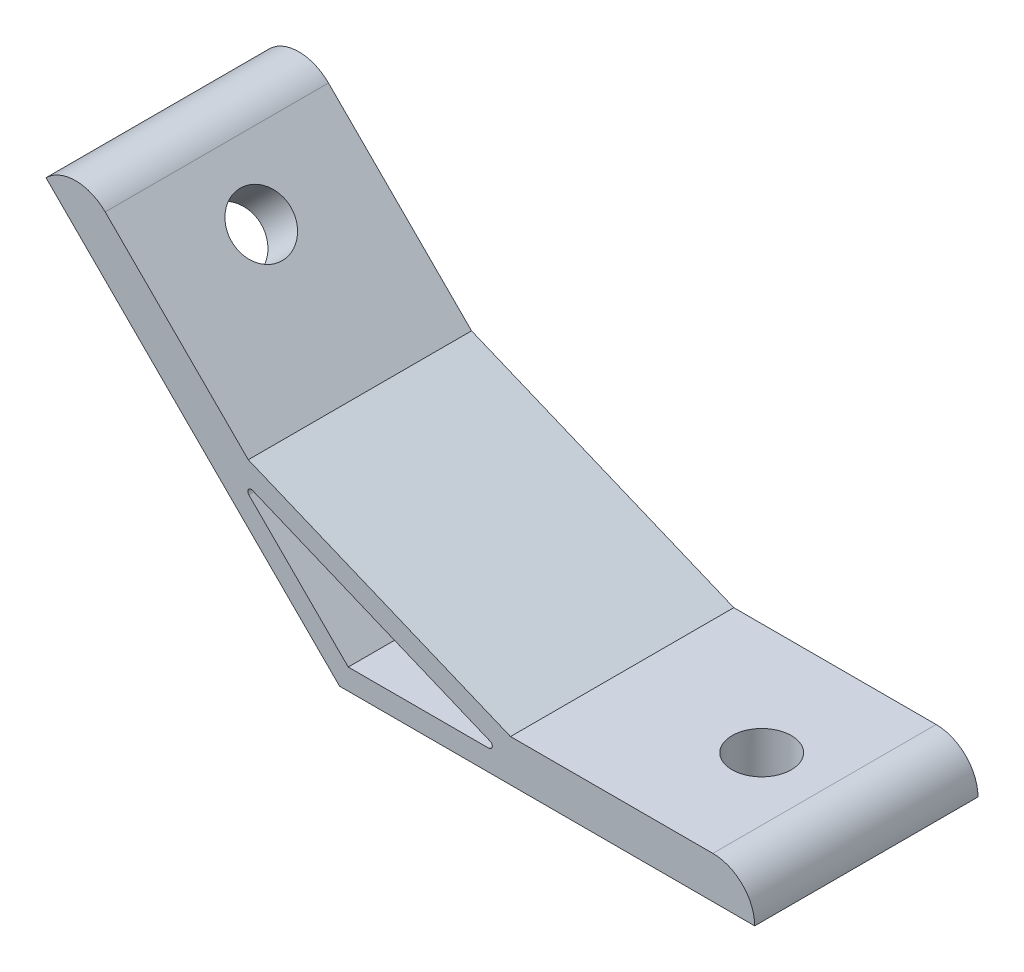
ISO-10303-21;
HEADER;
FILE_DESCRIPTION(('STEP AP214'),'2;1');
FILE_NAME('part.step','',(''),(''),'','','');
FILE_SCHEMA(('AUTOMOTIVE_DESIGN { 1 0 10303 214 1 1 1 1 }'));
ENDSEC;
DATA;
#1=APPLICATION_CONTEXT('core data for automotive mechanical design processes');
#2=APPLICATION_PROTOCOL_DEFINITION('international standard','automotive_design',2000,#1);
#3=PRODUCT_CONTEXT('',#1,'mechanical');
#4=PRODUCT('Part','Part','',(#3));
#5=PRODUCT_RELATED_PRODUCT_CATEGORY('part','',(#4));
#6=PRODUCT_DEFINITION_FORMATION('','',#4);
#7=PRODUCT_DEFINITION_CONTEXT('part definition',#1,'design');
#8=PRODUCT_DEFINITION('design','',#6,#7);
#9=PRODUCT_DEFINITION_SHAPE('','',#8);
#10=(LENGTH_UNIT() NAMED_UNIT(*) SI_UNIT(.MILLI.,.METRE.));
#11=(NAMED_UNIT(*) PLANE_ANGLE_UNIT() SI_UNIT($,.RADIAN.));
#12=(NAMED_UNIT(*) SI_UNIT($,.STERADIAN.) SOLID_ANGLE_UNIT());
#13=UNCERTAINTY_MEASURE_WITH_UNIT(LENGTH_MEASURE(1.E-05),#10,'distance_accuracy_value','');
#14=(GEOMETRIC_REPRESENTATION_CONTEXT(3) GLOBAL_UNCERTAINTY_ASSIGNED_CONTEXT((#13)) GLOBAL_UNIT_ASSIGNED_CONTEXT((#10,
#11,#12)) REPRESENTATION_CONTEXT('',''));
#15=CARTESIAN_POINT('',(0.,0.,0.));
#16=DIRECTION('',(0.,0.,1.));
#17=DIRECTION('',(1.,0.,0.));
#18=AXIS2_PLACEMENT_3D('',#15,#16,#17);
#19=CARTESIAN_POINT('',(0.,0.,16.));
#20=DIRECTION('',(0.,1.,0.));
#21=DIRECTION('',(0.,0.,1.));
#22=AXIS2_PLACEMENT_3D('',#19,#20,#21);
#23=PLANE('',#22);
#24=DIRECTION('',(1.,0.,0.));
#25=VECTOR('',#24,1.);
#26=CARTESIAN_POINT('',(0.,0.,-16.));
#27=LINE('',#26,#25);
#28=CARTESIAN_POINT('',(0.,0.,-16.));
#29=VERTEX_POINT('',#28);
#30=CARTESIAN_POINT('',(59.5,0.,-16.));
#31=VERTEX_POINT('',#30);
#32=EDGE_CURVE('E171',#29,#31,#27,.T.);
#33=ORIENTED_EDGE('',*,*,#32,.T.);
#34=DIRECTION('',(0.,0.,-1.));
#35=VECTOR('',#34,1.);
#36=CARTESIAN_POINT('',(59.5,0.,16.));
#37=LINE('',#36,#35);
#38=CARTESIAN_POINT('',(59.5,0.,16.));
#39=VERTEX_POINT('',#38);
#40=EDGE_CURVE('E188',#39,#31,#37,.T.);
#41=ORIENTED_EDGE('',*,*,#40,.F.);
#42=DIRECTION('',(1.,0.,0.));
#43=VECTOR('',#42,1.);
#44=CARTESIAN_POINT('',(0.,0.,16.));
#45=LINE('',#44,#43);
#46=CARTESIAN_POINT('',(0.,0.,16.));
#47=VERTEX_POINT('',#46);
#48=EDGE_CURVE('E158',#47,#39,#45,.T.);
#49=ORIENTED_EDGE('',*,*,#48,.F.);
#50=DIRECTION('',(0.,0.,-1.));
#51=VECTOR('',#50,1.);
#52=CARTESIAN_POINT('',(0.,0.,16.));
#53=LINE('',#52,#51);
#54=EDGE_CURVE('E191',#47,#29,#53,.T.);
#55=ORIENTED_EDGE('',*,*,#54,.T.);
#56=EDGE_LOOP('',(#33,#41,#49,#55));
#57=FACE_BOUND('',#56,.T.);
#58=CARTESIAN_POINT('',(44.5,0.,0.));
#59=DIRECTION('',(0.,1.,0.));
#60=DIRECTION('',(-1.,0.,0.));
#61=AXIS2_PLACEMENT_3D('',#58,#59,#60);
#62=CIRCLE('',#61,4.25);
#63=CARTESIAN_POINT('',(40.25,0.,0.));
#64=VERTEX_POINT('',#63);
#65=EDGE_CURVE('E216',#64,#64,#62,.T.);
#66=ORIENTED_EDGE('',*,*,#65,.T.);
#67=EDGE_LOOP('',(#66));
#68=FACE_BOUND('',#67,.T.);
#69=ADVANCED_FACE('F36',(#57,#68),#23,.F.);
#70=CARTESIAN_POINT('',(59.5,6.,16.));
#71=DIRECTION('',(0.,-1.,0.));
#72=DIRECTION('',(1.,0.,0.));
#73=AXIS2_PLACEMENT_3D('',#70,#71,#72);
#74=PLANE('',#73);
#75=DIRECTION('',(-1.,0.,0.));
#76=VECTOR('',#75,1.);
#77=CARTESIAN_POINT('',(59.5,6.,16.));
#78=LINE('',#77,#76);
#79=CARTESIAN_POINT('',(53.5,6.,16.));
#80=VERTEX_POINT('',#79);
#81=CARTESIAN_POINT('',(24.5,6.,16.));
#82=VERTEX_POINT('',#81);
#83=EDGE_CURVE('E161',#80,#82,#78,.T.);
#84=ORIENTED_EDGE('',*,*,#83,.F.);
#85=DIRECTION('',(0.,0.,-1.));
#86=VECTOR('',#85,1.);
#87=CARTESIAN_POINT('',(53.5,6.,16.));
#88=LINE('',#87,#86);
#89=CARTESIAN_POINT('',(53.5,6.,-16.));
#90=VERTEX_POINT('',#89);
#91=EDGE_CURVE('E212',#80,#90,#88,.T.);
#92=ORIENTED_EDGE('',*,*,#91,.T.);
#93=DIRECTION('',(-1.,0.,0.));
#94=VECTOR('',#93,1.);
#95=CARTESIAN_POINT('',(59.5,6.,-16.));
#96=LINE('',#95,#94);
#97=CARTESIAN_POINT('',(24.5,6.,-16.));
#98=VERTEX_POINT('',#97);
#99=EDGE_CURVE('E174',#90,#98,#96,.T.);
#100=ORIENTED_EDGE('',*,*,#99,.T.);
#101=DIRECTION('',(0.,0.,-1.));
#102=VECTOR('',#101,1.);
#103=CARTESIAN_POINT('',(24.5,6.,16.));
#104=LINE('',#103,#102);
#105=EDGE_CURVE('E185',#82,#98,#104,.T.);
#106=ORIENTED_EDGE('',*,*,#105,.F.);
#107=EDGE_LOOP('',(#84,#92,#100,#106));
#108=FACE_BOUND('',#107,.T.);
#109=CARTESIAN_POINT('',(44.5,5.99999999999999,0.));
#110=DIRECTION('',(0.,-1.,0.));
#111=DIRECTION('',(1.,0.,0.));
#112=AXIS2_PLACEMENT_3D('',#109,#110,#111);
#113=CIRCLE('',#112,4.25);
#114=CARTESIAN_POINT('',(48.75,6.,0.));
#115=VERTEX_POINT('',#114);
#116=EDGE_CURVE('E213',#115,#115,#113,.F.);
#117=ORIENTED_EDGE('',*,*,#116,.F.);
#118=EDGE_LOOP('',(#117));
#119=FACE_BOUND('',#118,.T.);
#120=ADVANCED_FACE('F250',(#108,#119),#74,.F.);
#121=CARTESIAN_POINT('',(0.,0.,16.));
#122=DIRECTION('',(0.707106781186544,0.707106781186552,0.));
#123=DIRECTION('',(-0.707106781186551,0.707106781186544,0.));
#124=AXIS2_PLACEMENT_3D('',#121,#122,#123);
#125=PLANE('',#124);
#126=CARTESIAN_POINT('',(-31.4662517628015,31.4662517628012,0.));
#127=DIRECTION('',(-0.707106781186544,-0.707106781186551,0.));
#128=DIRECTION('',(0.707106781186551,-0.707106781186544,0.));
#129=AXIS2_PLACEMENT_3D('',#126,#127,#128);
#130=CIRCLE('',#129,4.25);
#131=CARTESIAN_POINT('',(-28.4610479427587,28.4610479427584,0.));
#132=VERTEX_POINT('',#131);
#133=EDGE_CURVE('E206',#132,#132,#130,.T.);
#134=ORIENTED_EDGE('',*,*,#133,.F.);
#135=EDGE_LOOP('',(#134));
#136=FACE_BOUND('',#135,.T.);
#137=DIRECTION('',(0.707106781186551,-0.707106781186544,0.));
#138=VECTOR('',#137,1.);
#139=CARTESIAN_POINT('',(0.,0.,-16.));
#140=LINE('',#139,#138);
#141=CARTESIAN_POINT('',(-42.0728534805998,42.0728534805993,-16.));
#142=VERTEX_POINT('',#141);
#143=EDGE_CURVE('E142',#142,#29,#140,.T.);
#144=ORIENTED_EDGE('',*,*,#143,.T.);
#145=ORIENTED_EDGE('',*,*,#54,.F.);
#146=DIRECTION('',(0.707106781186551,-0.707106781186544,0.));
#147=VECTOR('',#146,1.);
#148=CARTESIAN_POINT('',(0.,0.,16.));
#149=LINE('',#148,#147);
#150=CARTESIAN_POINT('',(-42.0728534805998,42.0728534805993,16.));
#151=VERTEX_POINT('',#150);
#152=EDGE_CURVE('E155',#151,#47,#149,.T.);
#153=ORIENTED_EDGE('',*,*,#152,.F.);
#154=DIRECTION('',(0.,0.,-1.));
#155=VECTOR('',#154,1.);
#156=CARTESIAN_POINT('',(-42.0728534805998,42.0728534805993,16.));
#157=LINE('',#156,#155);
#158=EDGE_CURVE('E168',#151,#142,#157,.T.);
#159=ORIENTED_EDGE('',*,*,#158,.T.);
#160=EDGE_LOOP('',(#144,#145,#153,#159));
#161=FACE_BOUND('',#160,.T.);
#162=ADVANCED_FACE('F256',(#136,#161),#125,.F.);
#163=CARTESIAN_POINT('',(-13.0814754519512,21.5667568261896,16.));
#164=DIRECTION('',(-0.382683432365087,-0.923879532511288,0.));
#165=DIRECTION('',(0.923879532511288,-0.382683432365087,0.));
#166=AXIS2_PLACEMENT_3D('',#163,#164,#165);
#167=PLANE('',#166);
#168=DIRECTION('',(-0.923879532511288,0.382683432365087,0.));
#169=VECTOR('',#168,1.);
#170=CARTESIAN_POINT('',(-13.0814754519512,21.5667568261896,-16.));
#171=LINE('',#170,#169);
#172=CARTESIAN_POINT('',(-13.0814754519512,21.5667568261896,-16.));
#173=VERTEX_POINT('',#172);
#174=EDGE_CURVE('E176',#98,#173,#171,.T.);
#175=ORIENTED_EDGE('',*,*,#174,.T.);
#176=DIRECTION('',(0.,0.,-1.));
#177=VECTOR('',#176,1.);
#178=CARTESIAN_POINT('',(-13.0814754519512,21.5667568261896,16.));
#179=LINE('',#178,#177);
#180=CARTESIAN_POINT('',(-13.0814754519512,21.5667568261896,16.));
#181=VERTEX_POINT('',#180);
#182=EDGE_CURVE('E182',#181,#173,#179,.T.);
#183=ORIENTED_EDGE('',*,*,#182,.F.);
#184=DIRECTION('',(-0.923879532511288,0.382683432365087,0.));
#185=VECTOR('',#184,1.);
#186=CARTESIAN_POINT('',(-13.0814754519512,21.5667568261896,16.));
#187=LINE('',#186,#185);
#188=EDGE_CURVE('E163',#82,#181,#187,.T.);
#189=ORIENTED_EDGE('',*,*,#188,.F.);
#190=ORIENTED_EDGE('',*,*,#105,.T.);
#191=EDGE_LOOP('',(#175,#183,#189,#190));
#192=FACE_BOUND('',#191,.T.);
#193=ADVANCED_FACE('F262',(#192),#167,.F.);
#194=CARTESIAN_POINT('',(-37.8302127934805,46.3154941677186,16.));
#195=DIRECTION('',(-0.707106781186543,-0.707106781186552,0.));
#196=DIRECTION('',(0.707106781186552,-0.707106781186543,0.));
#197=AXIS2_PLACEMENT_3D('',#194,#195,#196);
#198=PLANE('',#197);
#199=CARTESIAN_POINT('',(-27.2236110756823,35.7088924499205,0.));
#200=DIRECTION('',(-0.707106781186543,-0.707106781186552,0.));
#201=DIRECTION('',(0.707106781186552,-0.707106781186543,0.));
#202=AXIS2_PLACEMENT_3D('',#199,#200,#201);
#203=CIRCLE('',#202,4.25);
#204=CARTESIAN_POINT('',(-24.2184072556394,32.7036886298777,0.));
#205=VERTEX_POINT('',#204);
#206=EDGE_CURVE('E152',#205,#205,#203,.T.);
#207=ORIENTED_EDGE('',*,*,#206,.T.);
#208=EDGE_LOOP('',(#207));
#209=FACE_BOUND('',#208,.T.);
#210=DIRECTION('',(-0.707106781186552,0.707106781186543,0.));
#211=VECTOR('',#210,1.);
#212=CARTESIAN_POINT('',(-37.8302127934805,46.3154941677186,-16.));
#213=LINE('',#212,#211);
#214=CARTESIAN_POINT('',(-33.5875721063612,42.0728534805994,-16.));
#215=VERTEX_POINT('',#214);
#216=EDGE_CURVE('E159',#173,#215,#213,.T.);
#217=ORIENTED_EDGE('',*,*,#216,.T.);
#218=DIRECTION('',(0.,0.,-1.));
#219=VECTOR('',#218,1.);
#220=CARTESIAN_POINT('',(-33.5875721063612,42.0728534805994,16.));
#221=LINE('',#220,#219);
#222=CARTESIAN_POINT('',(-33.5875721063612,42.0728534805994,16.));
#223=VERTEX_POINT('',#222);
#224=EDGE_CURVE('E208',#215,#223,#221,.F.);
#225=ORIENTED_EDGE('',*,*,#224,.T.);
#226=DIRECTION('',(-0.707106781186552,0.707106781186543,0.));
#227=VECTOR('',#226,1.);
#228=CARTESIAN_POINT('',(-37.8302127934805,46.3154941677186,16.));
#229=LINE('',#228,#227);
#230=EDGE_CURVE('E165',#181,#223,#229,.T.);
#231=ORIENTED_EDGE('',*,*,#230,.F.);
#232=ORIENTED_EDGE('',*,*,#182,.T.);
#233=EDGE_LOOP('',(#217,#225,#231,#232));
#234=FACE_BOUND('',#233,.T.);
#235=ADVANCED_FACE('F267',(#209,#234),#198,.F.);
#236=CARTESIAN_POINT('',(-42.0728534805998,42.0728534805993,16.));
#237=DIRECTION('',(0.,0.,-1.));
#238=DIRECTION('',(-1.,0.,0.));
#239=AXIS2_PLACEMENT_3D('',#236,#237,#238);
#240=PLANE('',#239);
#241=DIRECTION('',(1.,0.,0.));
#242=VECTOR('',#241,1.);
#243=CARTESIAN_POINT('',(1.24264068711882,3.,16.));
#244=LINE('',#243,#242);
#245=CARTESIAN_POINT('',(1.24264068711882,3.,16.));
#246=VERTEX_POINT('',#245);
#247=CARTESIAN_POINT('',(21.3895931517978,3.,16.));
#248=VERTEX_POINT('',#247);
#249=EDGE_CURVE('E151',#246,#248,#244,.T.);
#250=ORIENTED_EDGE('',*,*,#249,.F.);
#251=DIRECTION('',(0.707106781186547,-0.707106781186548,0.));
#252=VECTOR('',#251,1.);
#253=CARTESIAN_POINT('',(-14.7808389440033,19.0234796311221,16.));
#254=LINE('',#253,#252);
#255=CARTESIAN_POINT('',(-13.0034060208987,17.2460467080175,16.));
#256=VERTEX_POINT('',#255);
#257=EDGE_CURVE('E141',#256,#246,#254,.T.);
#258=ORIENTED_EDGE('',*,*,#257,.F.);
#259=CARTESIAN_POINT('',(-12.6498526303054,17.5996000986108,16.));
#260=DIRECTION('',(0.,0.,-1.));
#261=DIRECTION('',(-1.,0.,0.));
#262=AXIS2_PLACEMENT_3D('',#259,#260,#261);
#263=CIRCLE('',#262,0.5);
#264=CARTESIAN_POINT('',(-12.4585109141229,18.0615398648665,16.));
#265=VERTEX_POINT('',#264);
#266=EDGE_CURVE('E199',#256,#265,#263,.T.);
#267=ORIENTED_EDGE('',*,*,#266,.T.);
#268=DIRECTION('',(-0.923879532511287,0.38268343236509,0.));
#269=VECTOR('',#268,1.);
#270=CARTESIAN_POINT('',(-14.7808389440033,19.0234796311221,16.));
#271=LINE('',#270,#269);
#272=CARTESIAN_POINT('',(21.5809348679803,3.96193976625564,16.));
#273=VERTEX_POINT('',#272);
#274=EDGE_CURVE('E135',#273,#265,#271,.T.);
#275=ORIENTED_EDGE('',*,*,#274,.F.);
#276=CARTESIAN_POINT('',(21.3895931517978,3.5,16.));
#277=DIRECTION('',(0.,0.,-1.));
#278=DIRECTION('',(-1.,0.,0.));
#279=AXIS2_PLACEMENT_3D('',#276,#277,#278);
#280=CIRCLE('',#279,0.5);
#281=EDGE_CURVE('E44',#273,#248,#280,.T.);
#282=ORIENTED_EDGE('',*,*,#281,.T.);
#283=EDGE_LOOP('',(#250,#258,#267,#275,#282));
#284=FACE_BOUND('',#283,.T.);
#285=ORIENTED_EDGE('',*,*,#48,.T.);
#286=CARTESIAN_POINT('',(53.5,0.,16.));
#287=DIRECTION('',(0.,0.,-1.));
#288=DIRECTION('',(-1.,0.,0.));
#289=AXIS2_PLACEMENT_3D('',#286,#287,#288);
#290=CIRCLE('',#289,6.);
#291=EDGE_CURVE('E221',#39,#80,#290,.F.);
#292=ORIENTED_EDGE('',*,*,#291,.T.);
#293=ORIENTED_EDGE('',*,*,#83,.T.);
#294=ORIENTED_EDGE('',*,*,#188,.T.);
#295=ORIENTED_EDGE('',*,*,#230,.T.);
#296=CARTESIAN_POINT('',(-37.8302127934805,37.8302127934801,16.));
#297=DIRECTION('',(0.,0.,-1.));
#298=DIRECTION('',(-1.,0.,0.));
#299=AXIS2_PLACEMENT_3D('',#296,#297,#298);
#300=CIRCLE('',#299,6.);
#301=EDGE_CURVE('E210',#223,#151,#300,.F.);
#302=ORIENTED_EDGE('',*,*,#301,.T.);
#303=ORIENTED_EDGE('',*,*,#152,.T.);
#304=EDGE_LOOP('',(#285,#292,#293,#294,#295,#302,#303));
#305=FACE_BOUND('',#304,.T.);
#306=ADVANCED_FACE('F231',(#284,#305),#240,.F.);
#307=CARTESIAN_POINT('',(-42.0728534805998,42.0728534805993,-16.));
#308=DIRECTION('',(0.,0.,-1.));
#309=DIRECTION('',(-1.,0.,0.));
#310=AXIS2_PLACEMENT_3D('',#307,#308,#309);
#311=PLANE('',#310);
#312=DIRECTION('',(1.,0.,0.));
#313=VECTOR('',#312,1.);
#314=CARTESIAN_POINT('',(1.24264068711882,3.,-16.));
#315=LINE('',#314,#313);
#316=CARTESIAN_POINT('',(1.24264068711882,3.,-16.));
#317=VERTEX_POINT('',#316);
#318=CARTESIAN_POINT('',(21.3895931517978,3.,-16.));
#319=VERTEX_POINT('',#318);
#320=EDGE_CURVE('E128',#317,#319,#315,.T.);
#321=ORIENTED_EDGE('',*,*,#320,.T.);
#322=CARTESIAN_POINT('',(21.3895931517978,3.5,-16.));
#323=DIRECTION('',(0.,0.,-1.));
#324=DIRECTION('',(-1.,0.,0.));
#325=AXIS2_PLACEMENT_3D('',#322,#323,#324);
#326=CIRCLE('',#325,0.5);
#327=CARTESIAN_POINT('',(21.5809348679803,3.96193976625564,-16.));
#328=VERTEX_POINT('',#327);
#329=EDGE_CURVE('E11',#319,#328,#326,.F.);
#330=ORIENTED_EDGE('',*,*,#329,.T.);
#331=DIRECTION('',(-0.923879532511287,0.38268343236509,0.));
#332=VECTOR('',#331,1.);
#333=CARTESIAN_POINT('',(-14.7808389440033,19.0234796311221,-16.));
#334=LINE('',#333,#332);
#335=CARTESIAN_POINT('',(-12.4585109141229,18.0615398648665,-16.));
#336=VERTEX_POINT('',#335);
#337=EDGE_CURVE('E143',#328,#336,#334,.T.);
#338=ORIENTED_EDGE('',*,*,#337,.T.);
#339=CARTESIAN_POINT('',(-12.6498526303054,17.5996000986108,-16.));
#340=DIRECTION('',(0.,0.,-1.));
#341=DIRECTION('',(-1.,0.,0.));
#342=AXIS2_PLACEMENT_3D('',#339,#340,#341);
#343=CIRCLE('',#342,0.5);
#344=CARTESIAN_POINT('',(-13.0034060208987,17.2460467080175,-16.));
#345=VERTEX_POINT('',#344);
#346=EDGE_CURVE('E131',#336,#345,#343,.F.);
#347=ORIENTED_EDGE('',*,*,#346,.T.);
#348=DIRECTION('',(0.707106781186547,-0.707106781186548,0.));
#349=VECTOR('',#348,1.);
#350=CARTESIAN_POINT('',(-14.7808389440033,19.0234796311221,-16.));
#351=LINE('',#350,#349);
#352=EDGE_CURVE('E124',#345,#317,#351,.T.);
#353=ORIENTED_EDGE('',*,*,#352,.T.);
#354=EDGE_LOOP('',(#321,#330,#338,#347,#353));
#355=FACE_BOUND('',#354,.T.);
#356=ORIENTED_EDGE('',*,*,#99,.F.);
#357=CARTESIAN_POINT('',(53.5,0.,-16.));
#358=DIRECTION('',(0.,0.,-1.));
#359=DIRECTION('',(-1.,0.,0.));
#360=AXIS2_PLACEMENT_3D('',#357,#358,#359);
#361=CIRCLE('',#360,6.);
#362=EDGE_CURVE('E219',#90,#31,#361,.T.);
#363=ORIENTED_EDGE('',*,*,#362,.T.);
#364=ORIENTED_EDGE('',*,*,#32,.F.);
#365=ORIENTED_EDGE('',*,*,#143,.F.);
#366=CARTESIAN_POINT('',(-37.8302127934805,37.8302127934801,-16.));
#367=DIRECTION('',(0.,0.,-1.));
#368=DIRECTION('',(-1.,0.,0.));
#369=AXIS2_PLACEMENT_3D('',#366,#367,#368);
#370=CIRCLE('',#369,6.);
#371=EDGE_CURVE('E203',#142,#215,#370,.T.);
#372=ORIENTED_EDGE('',*,*,#371,.T.);
#373=ORIENTED_EDGE('',*,*,#216,.F.);
#374=ORIENTED_EDGE('',*,*,#174,.F.);
#375=EDGE_LOOP('',(#356,#363,#364,#365,#372,#373,#374));
#376=FACE_BOUND('',#375,.T.);
#377=ADVANCED_FACE('F126',(#355,#376),#311,.T.);
#378=CARTESIAN_POINT('',(-14.7808389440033,19.0234796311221,-16.));
#379=DIRECTION('',(-0.707106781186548,-0.707106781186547,0.));
#380=DIRECTION('',(0.707106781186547,-0.707106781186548,0.));
#381=AXIS2_PLACEMENT_3D('',#378,#379,#380);
#382=PLANE('',#381);
#383=ORIENTED_EDGE('',*,*,#352,.F.);
#384=DIRECTION('',(0.,0.,1.));
#385=VECTOR('',#384,1.);
#386=CARTESIAN_POINT('',(-13.0034060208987,17.2460467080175,16.));
#387=LINE('',#386,#385);
#388=EDGE_CURVE('E194',#345,#256,#387,.T.);
#389=ORIENTED_EDGE('',*,*,#388,.T.);
#390=ORIENTED_EDGE('',*,*,#257,.T.);
#391=DIRECTION('',(0.,0.,1.));
#392=VECTOR('',#391,1.);
#393=CARTESIAN_POINT('',(1.24264068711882,3.,-16.));
#394=LINE('',#393,#392);
#395=EDGE_CURVE('E138',#317,#246,#394,.T.);
#396=ORIENTED_EDGE('',*,*,#395,.F.);
#397=EDGE_LOOP('',(#383,#389,#390,#396));
#398=FACE_BOUND('',#397,.T.);
#399=ADVANCED_FACE('F139',(#398),#382,.F.);
#400=CARTESIAN_POINT('',(-14.7808389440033,19.0234796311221,-16.));
#401=DIRECTION('',(0.38268343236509,0.923879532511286,0.));
#402=DIRECTION('',(-0.923879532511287,0.38268343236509,0.));
#403=AXIS2_PLACEMENT_3D('',#400,#401,#402);
#404=PLANE('',#403);
#405=ORIENTED_EDGE('',*,*,#337,.F.);
#406=DIRECTION('',(0.,0.,1.));
#407=VECTOR('',#406,1.);
#408=CARTESIAN_POINT('',(21.5809348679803,3.96193976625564,16.));
#409=LINE('',#408,#407);
#410=EDGE_CURVE('E223',#328,#273,#409,.T.);
#411=ORIENTED_EDGE('',*,*,#410,.T.);
#412=ORIENTED_EDGE('',*,*,#274,.T.);
#413=DIRECTION('',(0.,0.,1.));
#414=VECTOR('',#413,1.);
#415=CARTESIAN_POINT('',(-12.4585109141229,18.0615398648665,-16.));
#416=LINE('',#415,#414);
#417=EDGE_CURVE('E196',#265,#336,#416,.F.);
#418=ORIENTED_EDGE('',*,*,#417,.T.);
#419=EDGE_LOOP('',(#405,#411,#412,#418));
#420=FACE_BOUND('',#419,.T.);
#421=ADVANCED_FACE('F229',(#420),#404,.F.);
#422=CARTESIAN_POINT('',(1.24264068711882,3.,-16.));
#423=DIRECTION('',(0.,-1.,0.));
#424=DIRECTION('',(0.,0.,-1.));
#425=AXIS2_PLACEMENT_3D('',#422,#423,#424);
#426=PLANE('',#425);
#427=ORIENTED_EDGE('',*,*,#249,.T.);
#428=DIRECTION('',(0.,0.,1.));
#429=VECTOR('',#428,1.);
#430=CARTESIAN_POINT('',(21.3895931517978,3.,-16.));
#431=LINE('',#430,#429);
#432=EDGE_CURVE('E51',#248,#319,#431,.F.);
#433=ORIENTED_EDGE('',*,*,#432,.T.);
#434=ORIENTED_EDGE('',*,*,#320,.F.);
#435=ORIENTED_EDGE('',*,*,#395,.T.);
#436=EDGE_LOOP('',(#427,#433,#434,#435));
#437=FACE_BOUND('',#436,.T.);
#438=ADVANCED_FACE('F145',(#437),#426,.F.);
#439=CARTESIAN_POINT('',(-12.6498526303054,17.5996000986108,-16.));
#440=DIRECTION('',(0.,0.,-1.));
#441=DIRECTION('',(-1.,0.,0.));
#442=AXIS2_PLACEMENT_3D('',#439,#440,#441);
#443=CYLINDRICAL_SURFACE('',#442,0.5);
#444=ORIENTED_EDGE('',*,*,#346,.F.);
#445=ORIENTED_EDGE('',*,*,#417,.F.);
#446=ORIENTED_EDGE('',*,*,#266,.F.);
#447=ORIENTED_EDGE('',*,*,#388,.F.);
#448=EDGE_LOOP('',(#444,#445,#446,#447));
#449=FACE_BOUND('',#448,.T.);
#450=ADVANCED_FACE('F235',(#449),#443,.F.);
#451=CARTESIAN_POINT('',(-8.83883476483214,54.0936687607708,0.));
#452=DIRECTION('',(-0.707106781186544,-0.707106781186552,0.));
#453=DIRECTION('',(0.707106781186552,-0.707106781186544,0.));
#454=AXIS2_PLACEMENT_3D('',#451,#452,#453);
#455=CYLINDRICAL_SURFACE('',#454,4.25);
#456=ORIENTED_EDGE('',*,*,#133,.T.);
#457=EDGE_LOOP('',(#456));
#458=FACE_BOUND('',#457,.T.);
#459=ORIENTED_EDGE('',*,*,#206,.F.);
#460=EDGE_LOOP('',(#459));
#461=FACE_BOUND('',#460,.T.);
#462=ADVANCED_FACE('F237',(#458,#461),#455,.F.);
#463=CARTESIAN_POINT('',(-37.8302127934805,37.8302127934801,16.));
#464=DIRECTION('',(0.,0.,-1.));
#465=DIRECTION('',(-1.,0.,0.));
#466=AXIS2_PLACEMENT_3D('',#463,#464,#465);
#467=CYLINDRICAL_SURFACE('',#466,6.);
#468=ORIENTED_EDGE('',*,*,#301,.F.);
#469=ORIENTED_EDGE('',*,*,#224,.F.);
#470=ORIENTED_EDGE('',*,*,#371,.F.);
#471=ORIENTED_EDGE('',*,*,#158,.F.);
#472=EDGE_LOOP('',(#468,#469,#470,#471));
#473=FACE_BOUND('',#472,.T.);
#474=ADVANCED_FACE('F243',(#473),#467,.T.);
#475=CARTESIAN_POINT('',(44.5,31.9999999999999,0.));
#476=DIRECTION('',(0.,-1.,0.));
#477=DIRECTION('',(1.,0.,0.));
#478=AXIS2_PLACEMENT_3D('',#475,#476,#477);
#479=CYLINDRICAL_SURFACE('',#478,4.25);
#480=ORIENTED_EDGE('',*,*,#65,.F.);
#481=EDGE_LOOP('',(#480));
#482=FACE_BOUND('',#481,.T.);
#483=ORIENTED_EDGE('',*,*,#116,.T.);
#484=EDGE_LOOP('',(#483));
#485=FACE_BOUND('',#484,.T.);
#486=ADVANCED_FACE('F295',(#482,#485),#479,.F.);
#487=CARTESIAN_POINT('',(53.5,0.,16.));
#488=DIRECTION('',(0.,0.,-1.));
#489=DIRECTION('',(-1.,0.,0.));
#490=AXIS2_PLACEMENT_3D('',#487,#488,#489);
#491=CYLINDRICAL_SURFACE('',#490,6.);
#492=ORIENTED_EDGE('',*,*,#291,.F.);
#493=ORIENTED_EDGE('',*,*,#40,.T.);
#494=ORIENTED_EDGE('',*,*,#362,.F.);
#495=ORIENTED_EDGE('',*,*,#91,.F.);
#496=EDGE_LOOP('',(#492,#493,#494,#495));
#497=FACE_BOUND('',#496,.T.);
#498=ADVANCED_FACE('F293',(#497),#491,.T.);
#499=CARTESIAN_POINT('',(21.3895931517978,3.5,-16.));
#500=DIRECTION('',(0.,0.,-1.));
#501=DIRECTION('',(-1.,0.,0.));
#502=AXIS2_PLACEMENT_3D('',#499,#500,#501);
#503=CYLINDRICAL_SURFACE('',#502,0.5);
#504=ORIENTED_EDGE('',*,*,#329,.F.);
#505=ORIENTED_EDGE('',*,*,#432,.F.);
#506=ORIENTED_EDGE('',*,*,#281,.F.);
#507=ORIENTED_EDGE('',*,*,#410,.F.);
#508=EDGE_LOOP('',(#504,#505,#506,#507));
#509=FACE_BOUND('',#508,.T.);
#510=ADVANCED_FACE('F38',(#509),#503,.F.);
#511=CLOSED_SHELL('',(#69,#120,#162,#193,#235,#306,#377,#399,#421,#438,#450,#462,#474,#486,#498,#510));
#512=MANIFOLD_SOLID_BREP('B2',#511);
#513=ADVANCED_BREP_SHAPE_REPRESENTATION('',(#18,#512),#14);
#514=SHAPE_DEFINITION_REPRESENTATION(#9,#513);
ENDSEC;
END-ISO-10303-21;
